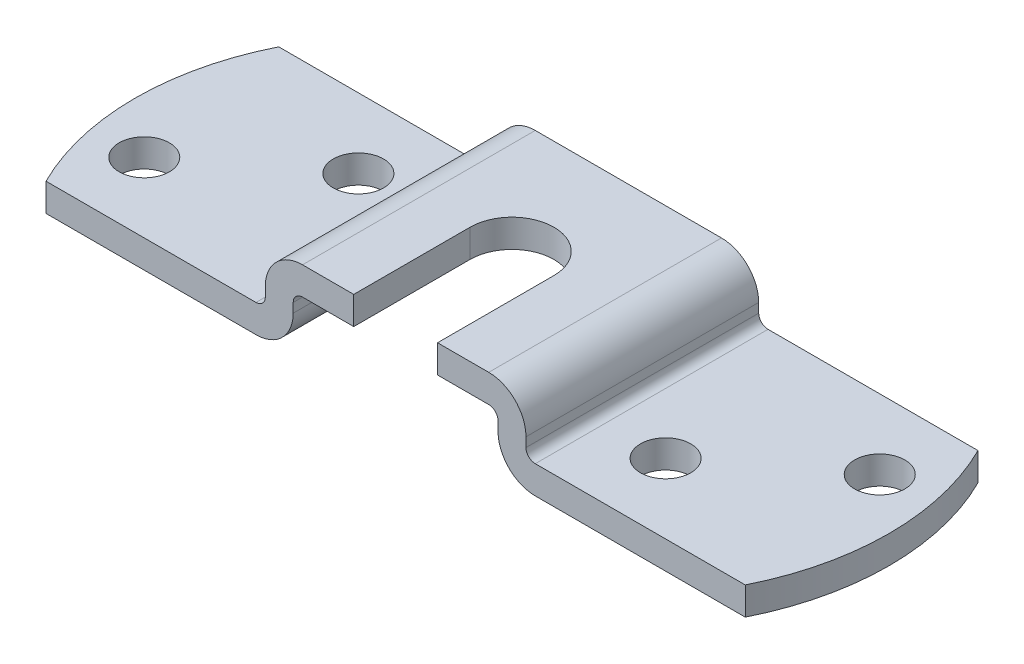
from build123d import *

# Parameters (mm, degrees)
EXTRUDE1_DEPTH = 25
EXTRUDE3_DEPTH = 48.971345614
EXTRUDE4_DEPTH = 49.438104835
SKETCH4_R      = 2.7
EXTRUDE5_DEPTH = 48.971345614


with BuildPart() as part:
    # Sketch1 → Extrude1 (new body)
    with BuildSketch(Plane.XY):
        with BuildLine():
            Line((10, 0), (-10, 0))
            ThreePointArc((-10, 0), (-12.828427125, -1.171572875), (-14, -4))
            Line((-14, -4), (-14, -5))
            ThreePointArc((-14, -5), (-14.292893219, -5.707106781), (-15, -6))
            Line((-15, -6), (-40.5, -6))
            Line((-40.5, -6), (-40.5, -9))
            Line((-40.5, -9), (-15, -9))
            ThreePointArc((-15, -9), (-12.171572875, -7.828427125), (-11, -5))
            Line((-11, -5), (-11, -4))
            ThreePointArc((-11, -4), (-10.707106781, -3.292893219), (-10, -3))
            Line((-10, -3), (10, -3))
            ThreePointArc((10, -3), (10.707106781, -3.292893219), (11, -4))
            Line((11, -4), (11, -5))
            ThreePointArc((11, -5), (12.171572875, -7.828427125), (15, -9))
            Line((15, -9), (40.5, -9))
            Line((40.5, -9), (40.5, -6))
            Line((40.5, -6), (15, -6))
            ThreePointArc((15, -6), (14.292893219, -5.707106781), (14, -5))
            Line((14, -5), (14, -4))
            ThreePointArc((14, -4), (12.828427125, -1.171572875), (10, 0))
        make_face()
    extrude(amount=EXTRUDE1_DEPTH)

    # Sketch2 → Extrude3 (cut, through all)
    with BuildSketch(Plane(origin=(0, -6, 0), x_dir=(1, 0, 0), z_dir=(0, 1, 0))):
        with BuildLine():
            ThreePointArc((-40.5, -12.5), (-39.753791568, -6.078875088), (-37.554939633, 0))
            Line((-37.554939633, 0), (-40.5, 0))
            Line((-40.5, 0), (-40.5, -12.5))
        make_face()
        with BuildLine():
            ThreePointArc((-37.554939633, -25), (-39.753791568, -18.921124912), (-40.5, -12.5))
            Line((-40.5, -12.5), (-40.5, -25))
            Line((-40.5, -25), (-37.554939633, -25))
        make_face()
        with BuildLine():
            ThreePointArc((37.554939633, 0), (39.753791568, -6.078875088), (40.5, -12.5))
            Line((40.5, -12.5), (40.5, 0))
            Line((40.5, 0), (37.554939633, 0))
        make_face()
        with BuildLine():
            ThreePointArc((40.5, -12.5), (39.753791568, -18.921124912), (37.554939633, -25))
            Line((37.554939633, -25), (40.5, -25))
            Line((40.5, -25), (40.5, -12.5))
        make_face()
    extrude(amount=-EXTRUDE3_DEPTH, mode=Mode.SUBTRACT)

    # Sketch3 → Extrude4 (cut, through all)
    with BuildSketch(Plane(origin=(0, 0, 0), x_dir=(1, 0, 0), z_dir=(0, 1, 0))):
        with BuildLine():
            Line((-4.5, -25), (-4.5, -12.5))
            ThreePointArc((-4.5, -12.5), (0, -8), (4.5, -12.5))
            Line((4.5, -12.5), (4.5, -25))
            Line((4.5, -25), (-4.5, -25))
        make_face()
    extrude(amount=-EXTRUDE4_DEPTH, mode=Mode.SUBTRACT)

    # Sketch4 → Extrude5 (cut, through all)
    with BuildSketch(Plane(origin=(0, -6, 0), x_dir=(1, 0, 0), z_dir=(0, 1, 0))):
        with Locations(Location((-34.5, -17.5, 0), (0, 0, 180))):
            Circle(SKETCH4_R)
        with Locations(Location((-21.5, -7.5, 0), (0, 0, 180))):
            Circle(SKETCH4_R)
        with Locations(Location((21.5, -17.5, 0), (0, 0, 180))):
            Circle(SKETCH4_R)
        with Locations(Location((34.5, -7.5, 0), (0, 0, 180))):
            Circle(SKETCH4_R)
    extrude(amount=-EXTRUDE5_DEPTH, mode=Mode.SUBTRACT)


solid = part.part
